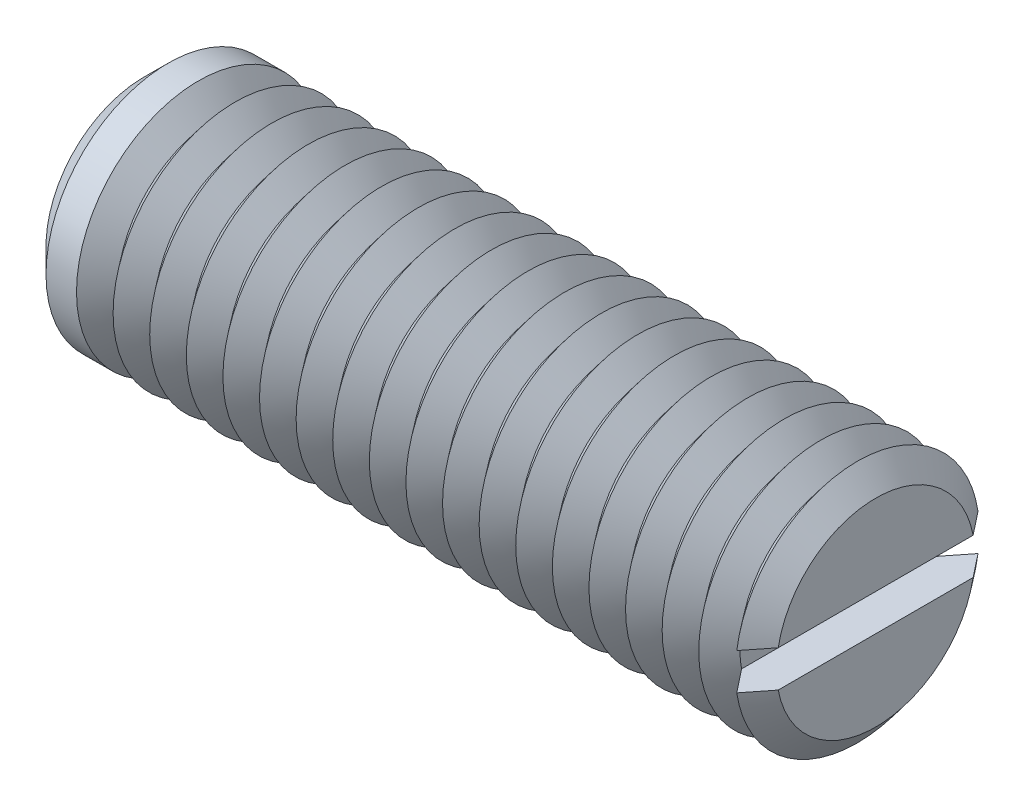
from build123d import *

# Parameters (mm, degrees)
SKETCH1_R       = 5
EXTRUDE1_DEPTH  = 15
SKETCH2_W       = 1.5
SKETCH2_H       = 1.5
EXTRUDE2_DEPTH  = 7.5
CHAMFER1_SIZE   = 1
LPATTERN1_COUNT = 19
LPATTERN1_PITCH = 1.5


with BuildPart() as part:
    # Sketch1 → Extrude1 (new, symmetric)
    with BuildSketch(Plane(origin=(0, 0, 0), x_dir=(0, 0, -1), z_dir=(1, 0, 0))):
        Circle(SKETCH1_R)
    extrude(amount=EXTRUDE1_DEPTH, both=True)

    # Sketch2 → Extrude2 (cut, symmetric)
    with BuildSketch(Plane.XY):
        with Locations((14.25, 0)):
            Rectangle(SKETCH2_W, SKETCH2_H)
    extrude(amount=EXTRUDE2_DEPTH, both=True, mode=Mode.SUBTRACT)

    # Chamfer1
    chamfer1_edges = [part.edges().sort_by_distance(p)[0] for p in [
        (-15, 0, 5),
    ]]
    chamfer(chamfer1_edges, length=CHAMFER1_SIZE)

    # Sketch3 → Cut-Revolve1 (revolve, cut)
    with BuildSketch(Plane.XY, mode=Mode.PRIVATE) as cut_revolve1_sk:
        Polygon((14.25, -5), (15.75, -5), (15, -4.0632503), align=None)
    cut_revolve1 = revolve(cut_revolve1_sk.sketch.rotate(Axis((0, 0, 0), (1, 0, 0)), 261.373073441), axis=Axis((0, 0, 0), (1, 0, 0)), mode=Mode.SUBTRACT)

    # LPattern1: Cut-Revolve1 ×19
    with Locations(*[(-i * LPATTERN1_PITCH, 0, 0) for i in range(1, LPATTERN1_COUNT)]):
        add(cut_revolve1, mode=Mode.SUBTRACT)


solid = part.part
